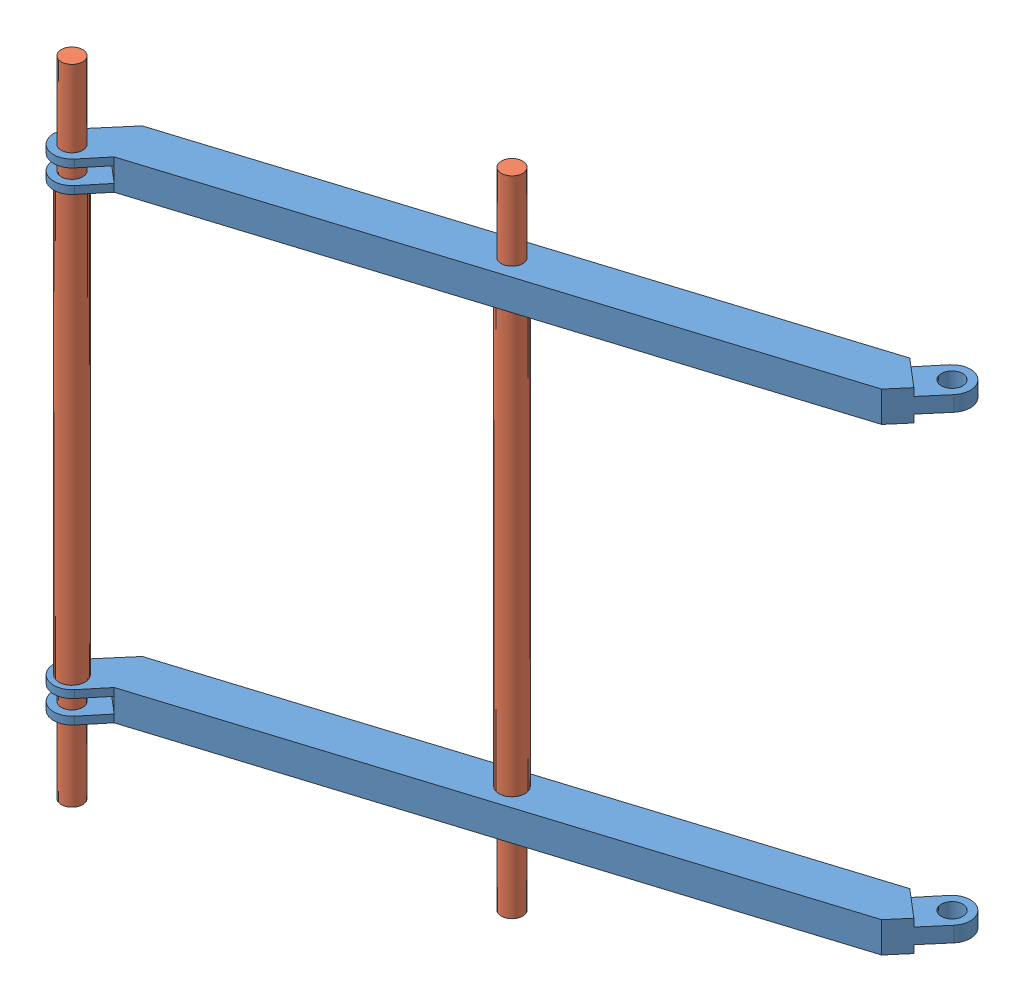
SolidWorks assembly layer_6.SLDASM, configuration Default (file format 11000). Lengths in mm.
Overall size (2311.11 2105.21 945.79).
4 component instances, 2 part files, 1 mates.
Components (placement in the parent):
- crossarm-1: crossarm.SLDPRT [Default] at (151.3438 750 2175.6762) x (0 1 0) z (0.954527 0 -0.298125) size (100 260 2340)
- crossarm-2: crossarm.SLDPRT [Default] at (151.3438 -750 2175.6762) x (0 1 0) z (0.954527 0 -0.298125) size (100 260 2340)
- cross_rod-3: cross_rod.SLDPRT [Default] at (-887.3124 0 2573.4115) x (0.99771 0 0.067633) z (0 -1 0) size (85 85 2100)
- cross_rod-2: cross_rod.SLDPRT [Default] at (151.3438 5.2104 2175.6762) x (1 0 0) z (0 1 0) size (85 85 2100)
Mates (geometry in assembly coordinates):
- Concentric1: concentric: cylinder of assembly; cylinder of assembly; cylinder of crossarm-2 through (151.3438 -800 2175.6762) axis (0 1 0) radius 35; cylinder of cross_rod-2 through (151.3438 1055.2104 2175.6762) axis (0 -1 0) radius 35
